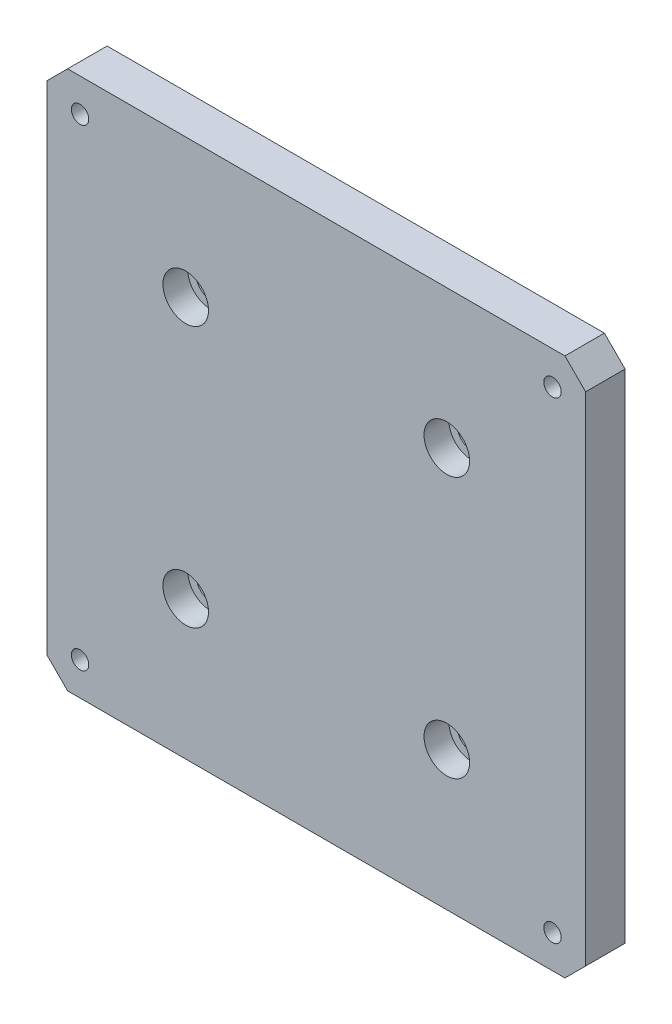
ISO-10303-21;
HEADER;
FILE_DESCRIPTION(('STEP AP214'),'2;1');
FILE_NAME('part.step','',(''),(''),'','','');
FILE_SCHEMA(('AUTOMOTIVE_DESIGN { 1 0 10303 214 1 1 1 1 }'));
ENDSEC;
DATA;
#1=APPLICATION_CONTEXT('core data for automotive mechanical design processes');
#2=APPLICATION_PROTOCOL_DEFINITION('international standard','automotive_design',2000,#1);
#3=PRODUCT_CONTEXT('',#1,'mechanical');
#4=PRODUCT('Part','Part','',(#3));
#5=PRODUCT_RELATED_PRODUCT_CATEGORY('part','',(#4));
#6=PRODUCT_DEFINITION_FORMATION('','',#4);
#7=PRODUCT_DEFINITION_CONTEXT('part definition',#1,'design');
#8=PRODUCT_DEFINITION('design','',#6,#7);
#9=PRODUCT_DEFINITION_SHAPE('','',#8);
#10=(LENGTH_UNIT() NAMED_UNIT(*) SI_UNIT(.MILLI.,.METRE.));
#11=(NAMED_UNIT(*) PLANE_ANGLE_UNIT() SI_UNIT($,.RADIAN.));
#12=(NAMED_UNIT(*) SI_UNIT($,.STERADIAN.) SOLID_ANGLE_UNIT());
#13=UNCERTAINTY_MEASURE_WITH_UNIT(LENGTH_MEASURE(1.E-05),#10,'distance_accuracy_value','');
#14=(GEOMETRIC_REPRESENTATION_CONTEXT(3) GLOBAL_UNCERTAINTY_ASSIGNED_CONTEXT((#13)) GLOBAL_UNIT_ASSIGNED_CONTEXT((#10,
#11,#12)) REPRESENTATION_CONTEXT('',''));
#15=CARTESIAN_POINT('',(0.,0.,0.));
#16=DIRECTION('',(0.,0.,1.));
#17=DIRECTION('',(1.,0.,0.));
#18=AXIS2_PLACEMENT_3D('',#15,#16,#17);
#19=CARTESIAN_POINT('',(0.,0.,4.7625));
#20=DIRECTION('',(0.,0.,-1.));
#21=DIRECTION('',(-1.,0.,0.));
#22=AXIS2_PLACEMENT_3D('',#19,#20,#21);
#23=PLANE('',#22);
#24=CARTESIAN_POINT('',(-31.5,31.5,4.7625));
#25=DIRECTION('',(0.,0.,1.));
#26=DIRECTION('',(1.,0.,0.));
#27=AXIS2_PLACEMENT_3D('',#24,#25,#26);
#28=CIRCLE('',#27,5.5);
#29=CARTESIAN_POINT('',(-26.,31.5,4.7625));
#30=VERTEX_POINT('',#29);
#31=EDGE_CURVE('E244',#30,#30,#28,.T.);
#32=ORIENTED_EDGE('',*,*,#31,.F.);
#33=EDGE_LOOP('',(#32));
#34=FACE_BOUND('',#33,.T.);
#35=CARTESIAN_POINT('',(31.5,31.5,4.7625));
#36=DIRECTION('',(0.,0.,1.));
#37=DIRECTION('',(1.,0.,0.));
#38=AXIS2_PLACEMENT_3D('',#35,#36,#37);
#39=CIRCLE('',#38,5.5);
#40=CARTESIAN_POINT('',(37.,31.5,4.7625));
#41=VERTEX_POINT('',#40);
#42=EDGE_CURVE('E232',#41,#41,#39,.T.);
#43=ORIENTED_EDGE('',*,*,#42,.F.);
#44=EDGE_LOOP('',(#43));
#45=FACE_BOUND('',#44,.T.);
#46=CARTESIAN_POINT('',(31.5,-31.5,4.7625));
#47=DIRECTION('',(0.,0.,1.));
#48=DIRECTION('',(1.,0.,0.));
#49=AXIS2_PLACEMENT_3D('',#46,#47,#48);
#50=CIRCLE('',#49,5.5);
#51=CARTESIAN_POINT('',(37.,-31.5,4.7625));
#52=VERTEX_POINT('',#51);
#53=EDGE_CURVE('E220',#52,#52,#50,.T.);
#54=ORIENTED_EDGE('',*,*,#53,.F.);
#55=EDGE_LOOP('',(#54));
#56=FACE_BOUND('',#55,.T.);
#57=CARTESIAN_POINT('',(-31.5,-31.5,4.7625));
#58=DIRECTION('',(0.,0.,1.));
#59=DIRECTION('',(1.,0.,0.));
#60=AXIS2_PLACEMENT_3D('',#57,#58,#59);
#61=CIRCLE('',#60,5.5);
#62=CARTESIAN_POINT('',(-26.,-31.5,4.7625));
#63=VERTEX_POINT('',#62);
#64=EDGE_CURVE('E208',#63,#63,#61,.T.);
#65=ORIENTED_EDGE('',*,*,#64,.F.);
#66=EDGE_LOOP('',(#65));
#67=FACE_BOUND('',#66,.T.);
#68=CARTESIAN_POINT('',(-57.,57.,4.7625));
#69=DIRECTION('',(0.,0.,1.));
#70=DIRECTION('',(1.,0.,0.));
#71=AXIS2_PLACEMENT_3D('',#68,#69,#70);
#72=CIRCLE('',#71,2.1);
#73=CARTESIAN_POINT('',(-54.9,57.,4.7625));
#74=VERTEX_POINT('',#73);
#75=EDGE_CURVE('E196',#74,#74,#72,.T.);
#76=ORIENTED_EDGE('',*,*,#75,.F.);
#77=EDGE_LOOP('',(#76));
#78=FACE_BOUND('',#77,.T.);
#79=CARTESIAN_POINT('',(-57.,-57.,4.7625));
#80=DIRECTION('',(0.,0.,1.));
#81=DIRECTION('',(1.,0.,0.));
#82=AXIS2_PLACEMENT_3D('',#79,#80,#81);
#83=CIRCLE('',#82,2.1);
#84=CARTESIAN_POINT('',(-54.9,-57.,4.7625));
#85=VERTEX_POINT('',#84);
#86=EDGE_CURVE('E184',#85,#85,#83,.T.);
#87=ORIENTED_EDGE('',*,*,#86,.F.);
#88=EDGE_LOOP('',(#87));
#89=FACE_BOUND('',#88,.T.);
#90=CARTESIAN_POINT('',(57.,-57.,4.7625));
#91=DIRECTION('',(0.,0.,1.));
#92=DIRECTION('',(1.,0.,0.));
#93=AXIS2_PLACEMENT_3D('',#90,#91,#92);
#94=CIRCLE('',#93,2.1);
#95=CARTESIAN_POINT('',(59.1,-57.,4.7625));
#96=VERTEX_POINT('',#95);
#97=EDGE_CURVE('E171',#96,#96,#94,.T.);
#98=ORIENTED_EDGE('',*,*,#97,.F.);
#99=EDGE_LOOP('',(#98));
#100=FACE_BOUND('',#99,.T.);
#101=DIRECTION('',(-1.,0.,0.));
#102=VECTOR('',#101,1.);
#103=CARTESIAN_POINT('',(65.,65.,4.7625));
#104=LINE('',#103,#102);
#105=CARTESIAN_POINT('',(60.,65.,4.7625));
#106=VERTEX_POINT('',#105);
#107=CARTESIAN_POINT('',(-60.,65.,4.7625));
#108=VERTEX_POINT('',#107);
#109=EDGE_CURVE('E175',#106,#108,#104,.T.);
#110=ORIENTED_EDGE('',*,*,#109,.T.);
#111=DIRECTION('',(0.707106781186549,0.707106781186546,0.));
#112=VECTOR('',#111,1.);
#113=CARTESIAN_POINT('',(-65.,60.,4.7625));
#114=LINE('',#113,#112);
#115=CARTESIAN_POINT('',(-65.,60.,4.7625));
#116=VERTEX_POINT('',#115);
#117=EDGE_CURVE('E152',#108,#116,#114,.F.);
#118=ORIENTED_EDGE('',*,*,#117,.T.);
#119=DIRECTION('',(0.,-1.,0.));
#120=VECTOR('',#119,1.);
#121=CARTESIAN_POINT('',(-65.,-65.,4.7625));
#122=LINE('',#121,#120);
#123=CARTESIAN_POINT('',(-65.,-59.9999999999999,4.7625));
#124=VERTEX_POINT('',#123);
#125=EDGE_CURVE('E124',#116,#124,#122,.T.);
#126=ORIENTED_EDGE('',*,*,#125,.T.);
#127=DIRECTION('',(-0.707106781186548,0.707106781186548,0.));
#128=VECTOR('',#127,1.);
#129=CARTESIAN_POINT('',(-60.,-65.,4.7625));
#130=LINE('',#129,#128);
#131=CARTESIAN_POINT('',(-60.,-65.,4.7625));
#132=VERTEX_POINT('',#131);
#133=EDGE_CURVE('E147',#124,#132,#130,.F.);
#134=ORIENTED_EDGE('',*,*,#133,.T.);
#135=DIRECTION('',(1.,0.,0.));
#136=VECTOR('',#135,1.);
#137=CARTESIAN_POINT('',(65.,-65.,4.7625));
#138=LINE('',#137,#136);
#139=CARTESIAN_POINT('',(60.,-65.,4.7625));
#140=VERTEX_POINT('',#139);
#141=EDGE_CURVE('E130',#132,#140,#138,.T.);
#142=ORIENTED_EDGE('',*,*,#141,.T.);
#143=DIRECTION('',(-0.707106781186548,-0.707106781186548,0.));
#144=VECTOR('',#143,1.);
#145=CARTESIAN_POINT('',(65.,-60.,4.7625));
#146=LINE('',#145,#144);
#147=CARTESIAN_POINT('',(65.,-60.,4.7625));
#148=VERTEX_POINT('',#147);
#149=EDGE_CURVE('E60',#140,#148,#146,.F.);
#150=ORIENTED_EDGE('',*,*,#149,.T.);
#151=DIRECTION('',(0.,1.,0.));
#152=VECTOR('',#151,1.);
#153=CARTESIAN_POINT('',(65.,-65.,4.7625));
#154=LINE('',#153,#152);
#155=CARTESIAN_POINT('',(65.,60.,4.7625));
#156=VERTEX_POINT('',#155);
#157=EDGE_CURVE('E133',#148,#156,#154,.T.);
#158=ORIENTED_EDGE('',*,*,#157,.T.);
#159=DIRECTION('',(0.707106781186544,-0.707106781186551,0.));
#160=VECTOR('',#159,1.);
#161=CARTESIAN_POINT('',(60.,65.,4.7625));
#162=LINE('',#161,#160);
#163=EDGE_CURVE('E150',#156,#106,#162,.F.);
#164=ORIENTED_EDGE('',*,*,#163,.T.);
#165=EDGE_LOOP('',(#110,#118,#126,#134,#142,#150,#158,#164));
#166=FACE_BOUND('',#165,.T.);
#167=CARTESIAN_POINT('',(57.,57.,4.7625));
#168=DIRECTION('',(0.,0.,1.));
#169=DIRECTION('',(1.,0.,0.));
#170=AXIS2_PLACEMENT_3D('',#167,#168,#169);
#171=CIRCLE('',#170,2.1);
#172=CARTESIAN_POINT('',(59.1,57.,4.7625));
#173=VERTEX_POINT('',#172);
#174=EDGE_CURVE('E190',#173,#173,#171,.T.);
#175=ORIENTED_EDGE('',*,*,#174,.F.);
#176=EDGE_LOOP('',(#175));
#177=FACE_BOUND('',#176,.T.);
#178=ADVANCED_FACE('F37',(#34,#45,#56,#67,#78,#89,#100,#166,#177),#23,.F.);
#179=CARTESIAN_POINT('',(65.,-65.,4.7625));
#180=DIRECTION('',(0.,1.,0.));
#181=DIRECTION('',(-1.,0.,0.));
#182=AXIS2_PLACEMENT_3D('',#179,#180,#181);
#183=PLANE('',#182);
#184=DIRECTION('',(1.,0.,0.));
#185=VECTOR('',#184,1.);
#186=CARTESIAN_POINT('',(65.,-65.,-4.7625));
#187=LINE('',#186,#185);
#188=CARTESIAN_POINT('',(-60.,-65.,-4.7625));
#189=VERTEX_POINT('',#188);
#190=CARTESIAN_POINT('',(60.,-65.,-4.7625));
#191=VERTEX_POINT('',#190);
#192=EDGE_CURVE('E163',#189,#191,#187,.T.);
#193=ORIENTED_EDGE('',*,*,#192,.T.);
#194=DIRECTION('',(0.,0.,1.));
#195=VECTOR('',#194,1.);
#196=CARTESIAN_POINT('',(60.,-65.,4.7625));
#197=LINE('',#196,#195);
#198=EDGE_CURVE('E11',#191,#140,#197,.T.);
#199=ORIENTED_EDGE('',*,*,#198,.T.);
#200=ORIENTED_EDGE('',*,*,#141,.F.);
#201=DIRECTION('',(0.,0.,-1.));
#202=VECTOR('',#201,1.);
#203=CARTESIAN_POINT('',(-60.,-65.,4.7625));
#204=LINE('',#203,#202);
#205=EDGE_CURVE('E46',#132,#189,#204,.T.);
#206=ORIENTED_EDGE('',*,*,#205,.T.);
#207=EDGE_LOOP('',(#193,#199,#200,#206));
#208=FACE_BOUND('',#207,.T.);
#209=ADVANCED_FACE('F162',(#208),#183,.F.);
#210=CARTESIAN_POINT('',(65.,-65.,4.7625));
#211=DIRECTION('',(-1.,0.,0.));
#212=DIRECTION('',(0.,-1.,0.));
#213=AXIS2_PLACEMENT_3D('',#210,#211,#212);
#214=PLANE('',#213);
#215=DIRECTION('',(0.,1.,0.));
#216=VECTOR('',#215,1.);
#217=CARTESIAN_POINT('',(65.,-65.,-4.7625));
#218=LINE('',#217,#216);
#219=CARTESIAN_POINT('',(65.,-60.,-4.7625));
#220=VERTEX_POINT('',#219);
#221=CARTESIAN_POINT('',(65.,60.,-4.7625));
#222=VERTEX_POINT('',#221);
#223=EDGE_CURVE('E135',#220,#222,#218,.T.);
#224=ORIENTED_EDGE('',*,*,#223,.T.);
#225=DIRECTION('',(0.,0.,1.));
#226=VECTOR('',#225,1.);
#227=CARTESIAN_POINT('',(65.,60.,4.7625));
#228=LINE('',#227,#226);
#229=EDGE_CURVE('E53',#222,#156,#228,.T.);
#230=ORIENTED_EDGE('',*,*,#229,.T.);
#231=ORIENTED_EDGE('',*,*,#157,.F.);
#232=DIRECTION('',(0.,0.,-1.));
#233=VECTOR('',#232,1.);
#234=CARTESIAN_POINT('',(65.,-60.,4.7625));
#235=LINE('',#234,#233);
#236=EDGE_CURVE('E154',#148,#220,#235,.T.);
#237=ORIENTED_EDGE('',*,*,#236,.T.);
#238=EDGE_LOOP('',(#224,#230,#231,#237));
#239=FACE_BOUND('',#238,.T.);
#240=ADVANCED_FACE('F301',(#239),#214,.F.);
#241=CARTESIAN_POINT('',(65.,65.,4.7625));
#242=DIRECTION('',(0.,-1.,0.));
#243=DIRECTION('',(0.,0.,-1.));
#244=AXIS2_PLACEMENT_3D('',#241,#242,#243);
#245=PLANE('',#244);
#246=DIRECTION('',(-1.,0.,0.));
#247=VECTOR('',#246,1.);
#248=CARTESIAN_POINT('',(65.,65.,-4.7625));
#249=LINE('',#248,#247);
#250=CARTESIAN_POINT('',(60.,65.,-4.7625));
#251=VERTEX_POINT('',#250);
#252=CARTESIAN_POINT('',(-60.,65.,-4.7625));
#253=VERTEX_POINT('',#252);
#254=EDGE_CURVE('E131',#251,#253,#249,.T.);
#255=ORIENTED_EDGE('',*,*,#254,.T.);
#256=DIRECTION('',(0.,0.,1.));
#257=VECTOR('',#256,1.);
#258=CARTESIAN_POINT('',(-60.,65.,4.7625));
#259=LINE('',#258,#257);
#260=EDGE_CURVE('E109',#253,#108,#259,.T.);
#261=ORIENTED_EDGE('',*,*,#260,.T.);
#262=ORIENTED_EDGE('',*,*,#109,.F.);
#263=DIRECTION('',(0.,0.,-1.));
#264=VECTOR('',#263,1.);
#265=CARTESIAN_POINT('',(60.,65.,4.7625));
#266=LINE('',#265,#264);
#267=EDGE_CURVE('E114',#106,#251,#266,.T.);
#268=ORIENTED_EDGE('',*,*,#267,.T.);
#269=EDGE_LOOP('',(#255,#261,#262,#268));
#270=FACE_BOUND('',#269,.T.);
#271=ADVANCED_FACE('F298',(#270),#245,.F.);
#272=CARTESIAN_POINT('',(-65.,-65.,4.7625));
#273=DIRECTION('',(1.,0.,0.));
#274=DIRECTION('',(0.,0.,-1.));
#275=AXIS2_PLACEMENT_3D('',#272,#273,#274);
#276=PLANE('',#275);
#277=ORIENTED_EDGE('',*,*,#125,.F.);
#278=DIRECTION('',(0.,0.,-1.));
#279=VECTOR('',#278,1.);
#280=CARTESIAN_POINT('',(-65.,60.,4.7625));
#281=LINE('',#280,#279);
#282=CARTESIAN_POINT('',(-65.,60.,-4.7625));
#283=VERTEX_POINT('',#282);
#284=EDGE_CURVE('E108',#116,#283,#281,.T.);
#285=ORIENTED_EDGE('',*,*,#284,.T.);
#286=DIRECTION('',(0.,-1.,0.));
#287=VECTOR('',#286,1.);
#288=CARTESIAN_POINT('',(-65.,-65.,-4.7625));
#289=LINE('',#288,#287);
#290=CARTESIAN_POINT('',(-65.,-59.9999999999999,-4.7625));
#291=VERTEX_POINT('',#290);
#292=EDGE_CURVE('E121',#283,#291,#289,.T.);
#293=ORIENTED_EDGE('',*,*,#292,.T.);
#294=DIRECTION('',(0.,0.,1.));
#295=VECTOR('',#294,1.);
#296=CARTESIAN_POINT('',(-65.,-59.9999999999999,4.7625));
#297=LINE('',#296,#295);
#298=EDGE_CURVE('E126',#291,#124,#297,.T.);
#299=ORIENTED_EDGE('',*,*,#298,.T.);
#300=EDGE_LOOP('',(#277,#285,#293,#299));
#301=FACE_BOUND('',#300,.T.);
#302=ADVANCED_FACE('F120',(#301),#276,.F.);
#303=CARTESIAN_POINT('',(0.,0.,-4.7625));
#304=DIRECTION('',(0.,0.,-1.));
#305=DIRECTION('',(-1.,0.,0.));
#306=AXIS2_PLACEMENT_3D('',#303,#304,#305);
#307=PLANE('',#306);
#308=CARTESIAN_POINT('',(-31.5,31.5,-4.7625));
#309=DIRECTION('',(0.,0.,-1.));
#310=DIRECTION('',(-1.,0.,0.));
#311=AXIS2_PLACEMENT_3D('',#308,#309,#310);
#312=CIRCLE('',#311,3.5);
#313=CARTESIAN_POINT('',(-35.,31.5,-4.7625));
#314=VERTEX_POINT('',#313);
#315=EDGE_CURVE('E235',#314,#314,#312,.T.);
#316=ORIENTED_EDGE('',*,*,#315,.F.);
#317=EDGE_LOOP('',(#316));
#318=FACE_BOUND('',#317,.T.);
#319=CARTESIAN_POINT('',(31.5,31.5,-4.7625));
#320=DIRECTION('',(0.,0.,-1.));
#321=DIRECTION('',(-1.,0.,0.));
#322=AXIS2_PLACEMENT_3D('',#319,#320,#321);
#323=CIRCLE('',#322,3.5);
#324=CARTESIAN_POINT('',(28.,31.5,-4.7625));
#325=VERTEX_POINT('',#324);
#326=EDGE_CURVE('E223',#325,#325,#323,.T.);
#327=ORIENTED_EDGE('',*,*,#326,.F.);
#328=EDGE_LOOP('',(#327));
#329=FACE_BOUND('',#328,.T.);
#330=CARTESIAN_POINT('',(31.5,-31.5,-4.7625));
#331=DIRECTION('',(0.,0.,-1.));
#332=DIRECTION('',(-1.,0.,0.));
#333=AXIS2_PLACEMENT_3D('',#330,#331,#332);
#334=CIRCLE('',#333,3.5);
#335=CARTESIAN_POINT('',(28.,-31.5,-4.7625));
#336=VERTEX_POINT('',#335);
#337=EDGE_CURVE('E211',#336,#336,#334,.T.);
#338=ORIENTED_EDGE('',*,*,#337,.F.);
#339=EDGE_LOOP('',(#338));
#340=FACE_BOUND('',#339,.T.);
#341=CARTESIAN_POINT('',(-31.5,-31.5,-4.7625));
#342=DIRECTION('',(0.,0.,-1.));
#343=DIRECTION('',(-1.,0.,0.));
#344=AXIS2_PLACEMENT_3D('',#341,#342,#343);
#345=CIRCLE('',#344,3.5);
#346=CARTESIAN_POINT('',(-35.,-31.5,-4.7625));
#347=VERTEX_POINT('',#346);
#348=EDGE_CURVE('E199',#347,#347,#345,.T.);
#349=ORIENTED_EDGE('',*,*,#348,.F.);
#350=EDGE_LOOP('',(#349));
#351=FACE_BOUND('',#350,.T.);
#352=CARTESIAN_POINT('',(-57.,57.,-4.7625));
#353=DIRECTION('',(0.,0.,-1.));
#354=DIRECTION('',(-1.,0.,0.));
#355=AXIS2_PLACEMENT_3D('',#352,#353,#354);
#356=CIRCLE('',#355,2.1);
#357=CARTESIAN_POINT('',(-59.1,57.,-4.7625));
#358=VERTEX_POINT('',#357);
#359=EDGE_CURVE('E193',#358,#358,#356,.T.);
#360=ORIENTED_EDGE('',*,*,#359,.F.);
#361=EDGE_LOOP('',(#360));
#362=FACE_BOUND('',#361,.T.);
#363=CARTESIAN_POINT('',(57.,57.,-4.7625));
#364=DIRECTION('',(0.,0.,-1.));
#365=DIRECTION('',(-1.,0.,0.));
#366=AXIS2_PLACEMENT_3D('',#363,#364,#365);
#367=CIRCLE('',#366,2.1);
#368=CARTESIAN_POINT('',(54.9,57.,-4.7625));
#369=VERTEX_POINT('',#368);
#370=EDGE_CURVE('E187',#369,#369,#367,.T.);
#371=ORIENTED_EDGE('',*,*,#370,.F.);
#372=EDGE_LOOP('',(#371));
#373=FACE_BOUND('',#372,.T.);
#374=CARTESIAN_POINT('',(-57.,-57.,-4.7625));
#375=DIRECTION('',(0.,0.,-1.));
#376=DIRECTION('',(-1.,0.,0.));
#377=AXIS2_PLACEMENT_3D('',#374,#375,#376);
#378=CIRCLE('',#377,2.1);
#379=CARTESIAN_POINT('',(-59.1,-57.,-4.7625));
#380=VERTEX_POINT('',#379);
#381=EDGE_CURVE('E181',#380,#380,#378,.T.);
#382=ORIENTED_EDGE('',*,*,#381,.F.);
#383=EDGE_LOOP('',(#382));
#384=FACE_BOUND('',#383,.T.);
#385=CARTESIAN_POINT('',(57.,-57.,-4.7625));
#386=DIRECTION('',(0.,0.,-1.));
#387=DIRECTION('',(-1.,0.,0.));
#388=AXIS2_PLACEMENT_3D('',#385,#386,#387);
#389=CIRCLE('',#388,2.1);
#390=CARTESIAN_POINT('',(54.9,-57.,-4.7625));
#391=VERTEX_POINT('',#390);
#392=EDGE_CURVE('E168',#391,#391,#389,.T.);
#393=ORIENTED_EDGE('',*,*,#392,.F.);
#394=EDGE_LOOP('',(#393));
#395=FACE_BOUND('',#394,.T.);
#396=ORIENTED_EDGE('',*,*,#292,.F.);
#397=DIRECTION('',(-0.707106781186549,-0.707106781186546,0.));
#398=VECTOR('',#397,1.);
#399=CARTESIAN_POINT('',(-62.4999999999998,62.5000000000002,-4.7625));
#400=LINE('',#399,#398);
#401=EDGE_CURVE('E104',#283,#253,#400,.F.);
#402=ORIENTED_EDGE('',*,*,#401,.T.);
#403=ORIENTED_EDGE('',*,*,#254,.F.);
#404=DIRECTION('',(-0.707106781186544,0.707106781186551,0.));
#405=VECTOR('',#404,1.);
#406=CARTESIAN_POINT('',(62.5000000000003,62.4999999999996,-4.7625));
#407=LINE('',#406,#405);
#408=EDGE_CURVE('E115',#251,#222,#407,.F.);
#409=ORIENTED_EDGE('',*,*,#408,.T.);
#410=ORIENTED_EDGE('',*,*,#223,.F.);
#411=DIRECTION('',(0.707106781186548,0.707106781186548,0.));
#412=VECTOR('',#411,1.);
#413=CARTESIAN_POINT('',(62.5,-62.5,-4.7625));
#414=LINE('',#413,#412);
#415=EDGE_CURVE('E141',#220,#191,#414,.F.);
#416=ORIENTED_EDGE('',*,*,#415,.T.);
#417=ORIENTED_EDGE('',*,*,#192,.F.);
#418=DIRECTION('',(0.707106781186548,-0.707106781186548,0.));
#419=VECTOR('',#418,1.);
#420=CARTESIAN_POINT('',(-62.5,-62.5,-4.7625));
#421=LINE('',#420,#419);
#422=EDGE_CURVE('E125',#189,#291,#421,.F.);
#423=ORIENTED_EDGE('',*,*,#422,.T.);
#424=EDGE_LOOP('',(#396,#402,#403,#409,#410,#416,#417,#423));
#425=FACE_BOUND('',#424,.T.);
#426=ADVANCED_FACE('F128',(#318,#329,#340,#351,#362,#373,#384,#395,#425),#307,.T.);
#427=CARTESIAN_POINT('',(-65.,60.,4.7625));
#428=DIRECTION('',(0.707106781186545,-0.707106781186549,0.));
#429=DIRECTION('',(0.,0.,-1.));
#430=AXIS2_PLACEMENT_3D('',#427,#428,#429);
#431=PLANE('',#430);
#432=ORIENTED_EDGE('',*,*,#117,.F.);
#433=ORIENTED_EDGE('',*,*,#260,.F.);
#434=ORIENTED_EDGE('',*,*,#401,.F.);
#435=ORIENTED_EDGE('',*,*,#284,.F.);
#436=EDGE_LOOP('',(#432,#433,#434,#435));
#437=FACE_BOUND('',#436,.T.);
#438=ADVANCED_FACE('F107',(#437),#431,.F.);
#439=CARTESIAN_POINT('',(60.,65.,4.7625));
#440=DIRECTION('',(-0.707106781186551,-0.707106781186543,0.));
#441=DIRECTION('',(0.,0.,-1.));
#442=AXIS2_PLACEMENT_3D('',#439,#440,#441);
#443=PLANE('',#442);
#444=ORIENTED_EDGE('',*,*,#163,.F.);
#445=ORIENTED_EDGE('',*,*,#229,.F.);
#446=ORIENTED_EDGE('',*,*,#408,.F.);
#447=ORIENTED_EDGE('',*,*,#267,.F.);
#448=EDGE_LOOP('',(#444,#445,#446,#447));
#449=FACE_BOUND('',#448,.T.);
#450=ADVANCED_FACE('F313',(#449),#443,.F.);
#451=CARTESIAN_POINT('',(65.,-60.,4.7625));
#452=DIRECTION('',(-0.707106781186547,0.707106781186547,0.));
#453=DIRECTION('',(0.,0.,-1.));
#454=AXIS2_PLACEMENT_3D('',#451,#452,#453);
#455=PLANE('',#454);
#456=ORIENTED_EDGE('',*,*,#149,.F.);
#457=ORIENTED_EDGE('',*,*,#198,.F.);
#458=ORIENTED_EDGE('',*,*,#415,.F.);
#459=ORIENTED_EDGE('',*,*,#236,.F.);
#460=EDGE_LOOP('',(#456,#457,#458,#459));
#461=FACE_BOUND('',#460,.T.);
#462=ADVANCED_FACE('F294',(#461),#455,.F.);
#463=CARTESIAN_POINT('',(-60.,-65.,4.7625));
#464=DIRECTION('',(0.707106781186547,0.707106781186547,0.));
#465=DIRECTION('',(0.,0.,-1.));
#466=AXIS2_PLACEMENT_3D('',#463,#464,#465);
#467=PLANE('',#466);
#468=ORIENTED_EDGE('',*,*,#133,.F.);
#469=ORIENTED_EDGE('',*,*,#298,.F.);
#470=ORIENTED_EDGE('',*,*,#422,.F.);
#471=ORIENTED_EDGE('',*,*,#205,.F.);
#472=EDGE_LOOP('',(#468,#469,#470,#471));
#473=FACE_BOUND('',#472,.T.);
#474=ADVANCED_FACE('F40',(#473),#467,.F.);
#475=CARTESIAN_POINT('',(57.,-57.,4.7625));
#476=DIRECTION('',(0.,0.,1.));
#477=DIRECTION('',(1.,0.,0.));
#478=AXIS2_PLACEMENT_3D('',#475,#476,#477);
#479=CYLINDRICAL_SURFACE('',#478,2.1);
#480=ORIENTED_EDGE('',*,*,#97,.T.);
#481=EDGE_LOOP('',(#480));
#482=FACE_BOUND('',#481,.T.);
#483=ORIENTED_EDGE('',*,*,#392,.T.);
#484=EDGE_LOOP('',(#483));
#485=FACE_BOUND('',#484,.T.);
#486=ADVANCED_FACE('F284',(#482,#485),#479,.F.);
#487=CARTESIAN_POINT('',(-57.,-57.,4.7625));
#488=DIRECTION('',(0.,0.,1.));
#489=DIRECTION('',(1.,0.,0.));
#490=AXIS2_PLACEMENT_3D('',#487,#488,#489);
#491=CYLINDRICAL_SURFACE('',#490,2.1);
#492=ORIENTED_EDGE('',*,*,#86,.T.);
#493=EDGE_LOOP('',(#492));
#494=FACE_BOUND('',#493,.T.);
#495=ORIENTED_EDGE('',*,*,#381,.T.);
#496=EDGE_LOOP('',(#495));
#497=FACE_BOUND('',#496,.T.);
#498=ADVANCED_FACE('F272',(#494,#497),#491,.F.);
#499=CARTESIAN_POINT('',(57.,57.,4.7625));
#500=DIRECTION('',(0.,0.,1.));
#501=DIRECTION('',(1.,0.,0.));
#502=AXIS2_PLACEMENT_3D('',#499,#500,#501);
#503=CYLINDRICAL_SURFACE('',#502,2.1);
#504=ORIENTED_EDGE('',*,*,#174,.T.);
#505=EDGE_LOOP('',(#504));
#506=FACE_BOUND('',#505,.T.);
#507=ORIENTED_EDGE('',*,*,#370,.T.);
#508=EDGE_LOOP('',(#507));
#509=FACE_BOUND('',#508,.T.);
#510=ADVANCED_FACE('F268',(#506,#509),#503,.F.);
#511=CARTESIAN_POINT('',(-57.,57.,4.7625));
#512=DIRECTION('',(0.,0.,1.));
#513=DIRECTION('',(1.,0.,0.));
#514=AXIS2_PLACEMENT_3D('',#511,#512,#513);
#515=CYLINDRICAL_SURFACE('',#514,2.1);
#516=ORIENTED_EDGE('',*,*,#75,.T.);
#517=EDGE_LOOP('',(#516));
#518=FACE_BOUND('',#517,.T.);
#519=ORIENTED_EDGE('',*,*,#359,.T.);
#520=EDGE_LOOP('',(#519));
#521=FACE_BOUND('',#520,.T.);
#522=ADVANCED_FACE('F271',(#518,#521),#515,.F.);
#523=CARTESIAN_POINT('',(-31.5,-31.5,4.7625));
#524=DIRECTION('',(0.,0.,1.));
#525=DIRECTION('',(1.,0.,0.));
#526=AXIS2_PLACEMENT_3D('',#523,#524,#525);
#527=CYLINDRICAL_SURFACE('',#526,3.5);
#528=CARTESIAN_POINT('',(-31.5,-31.5,-1.2375));
#529=DIRECTION('',(0.,0.,1.));
#530=DIRECTION('',(1.,0.,0.));
#531=AXIS2_PLACEMENT_3D('',#528,#529,#530);
#532=CIRCLE('',#531,3.5);
#533=CARTESIAN_POINT('',(-28.,-31.5,-1.2375));
#534=VERTEX_POINT('',#533);
#535=EDGE_CURVE('E202',#534,#534,#532,.T.);
#536=ORIENTED_EDGE('',*,*,#535,.T.);
#537=EDGE_LOOP('',(#536));
#538=FACE_BOUND('',#537,.T.);
#539=ORIENTED_EDGE('',*,*,#348,.T.);
#540=EDGE_LOOP('',(#539));
#541=FACE_BOUND('',#540,.T.);
#542=ADVANCED_FACE('F360',(#538,#541),#527,.F.);
#543=CARTESIAN_POINT('',(-28.,-31.5,-1.2375));
#544=DIRECTION('',(0.,0.,-1.));
#545=DIRECTION('',(-1.,0.,0.));
#546=AXIS2_PLACEMENT_3D('',#543,#544,#545);
#547=PLANE('',#546);
#548=ORIENTED_EDGE('',*,*,#535,.F.);
#549=EDGE_LOOP('',(#548));
#550=FACE_BOUND('',#549,.T.);
#551=CARTESIAN_POINT('',(-31.5,-31.5,-1.2375));
#552=DIRECTION('',(0.,0.,1.));
#553=DIRECTION('',(1.,0.,0.));
#554=AXIS2_PLACEMENT_3D('',#551,#552,#553);
#555=CIRCLE('',#554,5.5);
#556=CARTESIAN_POINT('',(-26.,-31.5,-1.2375));
#557=VERTEX_POINT('',#556);
#558=EDGE_CURVE('E205',#557,#557,#555,.T.);
#559=ORIENTED_EDGE('',*,*,#558,.T.);
#560=EDGE_LOOP('',(#559));
#561=FACE_BOUND('',#560,.T.);
#562=ADVANCED_FACE('F383',(#550,#561),#547,.F.);
#563=CARTESIAN_POINT('',(-31.5,-31.5,4.7625));
#564=DIRECTION('',(0.,0.,1.));
#565=DIRECTION('',(1.,0.,0.));
#566=AXIS2_PLACEMENT_3D('',#563,#564,#565);
#567=CYLINDRICAL_SURFACE('',#566,5.5);
#568=ORIENTED_EDGE('',*,*,#558,.F.);
#569=EDGE_LOOP('',(#568));
#570=FACE_BOUND('',#569,.T.);
#571=ORIENTED_EDGE('',*,*,#64,.T.);
#572=EDGE_LOOP('',(#571));
#573=FACE_BOUND('',#572,.T.);
#574=ADVANCED_FACE('F393',(#570,#573),#567,.F.);
#575=CARTESIAN_POINT('',(31.5,-31.5,4.7625));
#576=DIRECTION('',(0.,0.,1.));
#577=DIRECTION('',(1.,0.,0.));
#578=AXIS2_PLACEMENT_3D('',#575,#576,#577);
#579=CYLINDRICAL_SURFACE('',#578,3.5);
#580=CARTESIAN_POINT('',(31.5,-31.5,-1.2375));
#581=DIRECTION('',(0.,0.,1.));
#582=DIRECTION('',(1.,0.,0.));
#583=AXIS2_PLACEMENT_3D('',#580,#581,#582);
#584=CIRCLE('',#583,3.5);
#585=CARTESIAN_POINT('',(35.,-31.5,-1.2375));
#586=VERTEX_POINT('',#585);
#587=EDGE_CURVE('E214',#586,#586,#584,.T.);
#588=ORIENTED_EDGE('',*,*,#587,.T.);
#589=EDGE_LOOP('',(#588));
#590=FACE_BOUND('',#589,.T.);
#591=ORIENTED_EDGE('',*,*,#337,.T.);
#592=EDGE_LOOP('',(#591));
#593=FACE_BOUND('',#592,.T.);
#594=ADVANCED_FACE('F403',(#590,#593),#579,.F.);
#595=CARTESIAN_POINT('',(35.,-31.5,-1.2375));
#596=DIRECTION('',(0.,0.,-1.));
#597=DIRECTION('',(-1.,0.,0.));
#598=AXIS2_PLACEMENT_3D('',#595,#596,#597);
#599=PLANE('',#598);
#600=ORIENTED_EDGE('',*,*,#587,.F.);
#601=EDGE_LOOP('',(#600));
#602=FACE_BOUND('',#601,.T.);
#603=CARTESIAN_POINT('',(31.5,-31.5,-1.2375));
#604=DIRECTION('',(0.,0.,1.));
#605=DIRECTION('',(1.,0.,0.));
#606=AXIS2_PLACEMENT_3D('',#603,#604,#605);
#607=CIRCLE('',#606,5.5);
#608=CARTESIAN_POINT('',(37.,-31.5,-1.2375));
#609=VERTEX_POINT('',#608);
#610=EDGE_CURVE('E217',#609,#609,#607,.T.);
#611=ORIENTED_EDGE('',*,*,#610,.T.);
#612=EDGE_LOOP('',(#611));
#613=FACE_BOUND('',#612,.T.);
#614=ADVANCED_FACE('F413',(#602,#613),#599,.F.);
#615=CARTESIAN_POINT('',(31.5,-31.5,4.7625));
#616=DIRECTION('',(0.,0.,1.));
#617=DIRECTION('',(1.,0.,0.));
#618=AXIS2_PLACEMENT_3D('',#615,#616,#617);
#619=CYLINDRICAL_SURFACE('',#618,5.5);
#620=ORIENTED_EDGE('',*,*,#610,.F.);
#621=EDGE_LOOP('',(#620));
#622=FACE_BOUND('',#621,.T.);
#623=ORIENTED_EDGE('',*,*,#53,.T.);
#624=EDGE_LOOP('',(#623));
#625=FACE_BOUND('',#624,.T.);
#626=ADVANCED_FACE('F423',(#622,#625),#619,.F.);
#627=CARTESIAN_POINT('',(31.5,31.5,4.7625));
#628=DIRECTION('',(0.,0.,1.));
#629=DIRECTION('',(1.,0.,0.));
#630=AXIS2_PLACEMENT_3D('',#627,#628,#629);
#631=CYLINDRICAL_SURFACE('',#630,3.5);
#632=CARTESIAN_POINT('',(31.5,31.5,-1.2375));
#633=DIRECTION('',(0.,0.,1.));
#634=DIRECTION('',(1.,0.,0.));
#635=AXIS2_PLACEMENT_3D('',#632,#633,#634);
#636=CIRCLE('',#635,3.5);
#637=CARTESIAN_POINT('',(35.,31.5,-1.2375));
#638=VERTEX_POINT('',#637);
#639=EDGE_CURVE('E226',#638,#638,#636,.T.);
#640=ORIENTED_EDGE('',*,*,#639,.T.);
#641=EDGE_LOOP('',(#640));
#642=FACE_BOUND('',#641,.T.);
#643=ORIENTED_EDGE('',*,*,#326,.T.);
#644=EDGE_LOOP('',(#643));
#645=FACE_BOUND('',#644,.T.);
#646=ADVANCED_FACE('F433',(#642,#645),#631,.F.);
#647=CARTESIAN_POINT('',(35.,31.5,-1.2375));
#648=DIRECTION('',(0.,0.,-1.));
#649=DIRECTION('',(-1.,0.,0.));
#650=AXIS2_PLACEMENT_3D('',#647,#648,#649);
#651=PLANE('',#650);
#652=ORIENTED_EDGE('',*,*,#639,.F.);
#653=EDGE_LOOP('',(#652));
#654=FACE_BOUND('',#653,.T.);
#655=CARTESIAN_POINT('',(31.5,31.5,-1.2375));
#656=DIRECTION('',(0.,0.,1.));
#657=DIRECTION('',(1.,0.,0.));
#658=AXIS2_PLACEMENT_3D('',#655,#656,#657);
#659=CIRCLE('',#658,5.5);
#660=CARTESIAN_POINT('',(37.,31.5,-1.2375));
#661=VERTEX_POINT('',#660);
#662=EDGE_CURVE('E229',#661,#661,#659,.T.);
#663=ORIENTED_EDGE('',*,*,#662,.T.);
#664=EDGE_LOOP('',(#663));
#665=FACE_BOUND('',#664,.T.);
#666=ADVANCED_FACE('F443',(#654,#665),#651,.F.);
#667=CARTESIAN_POINT('',(31.5,31.5,4.7625));
#668=DIRECTION('',(0.,0.,1.));
#669=DIRECTION('',(1.,0.,0.));
#670=AXIS2_PLACEMENT_3D('',#667,#668,#669);
#671=CYLINDRICAL_SURFACE('',#670,5.5);
#672=ORIENTED_EDGE('',*,*,#662,.F.);
#673=EDGE_LOOP('',(#672));
#674=FACE_BOUND('',#673,.T.);
#675=ORIENTED_EDGE('',*,*,#42,.T.);
#676=EDGE_LOOP('',(#675));
#677=FACE_BOUND('',#676,.T.);
#678=ADVANCED_FACE('F453',(#674,#677),#671,.F.);
#679=CARTESIAN_POINT('',(-31.5,31.5,4.7625));
#680=DIRECTION('',(0.,0.,1.));
#681=DIRECTION('',(1.,0.,0.));
#682=AXIS2_PLACEMENT_3D('',#679,#680,#681);
#683=CYLINDRICAL_SURFACE('',#682,3.5);
#684=CARTESIAN_POINT('',(-31.5,31.5,-1.2375));
#685=DIRECTION('',(0.,0.,1.));
#686=DIRECTION('',(1.,0.,0.));
#687=AXIS2_PLACEMENT_3D('',#684,#685,#686);
#688=CIRCLE('',#687,3.5);
#689=CARTESIAN_POINT('',(-28.,31.5,-1.2375));
#690=VERTEX_POINT('',#689);
#691=EDGE_CURVE('E238',#690,#690,#688,.T.);
#692=ORIENTED_EDGE('',*,*,#691,.T.);
#693=EDGE_LOOP('',(#692));
#694=FACE_BOUND('',#693,.T.);
#695=ORIENTED_EDGE('',*,*,#315,.T.);
#696=EDGE_LOOP('',(#695));
#697=FACE_BOUND('',#696,.T.);
#698=ADVANCED_FACE('F463',(#694,#697),#683,.F.);
#699=CARTESIAN_POINT('',(-28.,31.5,-1.2375));
#700=DIRECTION('',(0.,0.,-1.));
#701=DIRECTION('',(-1.,0.,0.));
#702=AXIS2_PLACEMENT_3D('',#699,#700,#701);
#703=PLANE('',#702);
#704=ORIENTED_EDGE('',*,*,#691,.F.);
#705=EDGE_LOOP('',(#704));
#706=FACE_BOUND('',#705,.T.);
#707=CARTESIAN_POINT('',(-31.5,31.5,-1.2375));
#708=DIRECTION('',(0.,0.,1.));
#709=DIRECTION('',(1.,0.,0.));
#710=AXIS2_PLACEMENT_3D('',#707,#708,#709);
#711=CIRCLE('',#710,5.5);
#712=CARTESIAN_POINT('',(-26.,31.5,-1.2375));
#713=VERTEX_POINT('',#712);
#714=EDGE_CURVE('E241',#713,#713,#711,.T.);
#715=ORIENTED_EDGE('',*,*,#714,.T.);
#716=EDGE_LOOP('',(#715));
#717=FACE_BOUND('',#716,.T.);
#718=ADVANCED_FACE('F473',(#706,#717),#703,.F.);
#719=CARTESIAN_POINT('',(-31.5,31.5,4.7625));
#720=DIRECTION('',(0.,0.,1.));
#721=DIRECTION('',(1.,0.,0.));
#722=AXIS2_PLACEMENT_3D('',#719,#720,#721);
#723=CYLINDRICAL_SURFACE('',#722,5.5);
#724=ORIENTED_EDGE('',*,*,#714,.F.);
#725=EDGE_LOOP('',(#724));
#726=FACE_BOUND('',#725,.T.);
#727=ORIENTED_EDGE('',*,*,#31,.T.);
#728=EDGE_LOOP('',(#727));
#729=FACE_BOUND('',#728,.T.);
#730=ADVANCED_FACE('F248',(#726,#729),#723,.F.);
#731=CLOSED_SHELL('',(#178,#209,#240,#271,#302,#426,#438,#450,#462,#474,#486,#498,#510,#522,
#542,#562,#574,#594,#614,#626,#646,#666,#678,#698,#718,#730));
#732=MANIFOLD_SOLID_BREP('B2',#731);
#733=ADVANCED_BREP_SHAPE_REPRESENTATION('',(#18,#732),#14);
#734=SHAPE_DEFINITION_REPRESENTATION(#9,#733);
ENDSEC;
END-ISO-10303-21;
